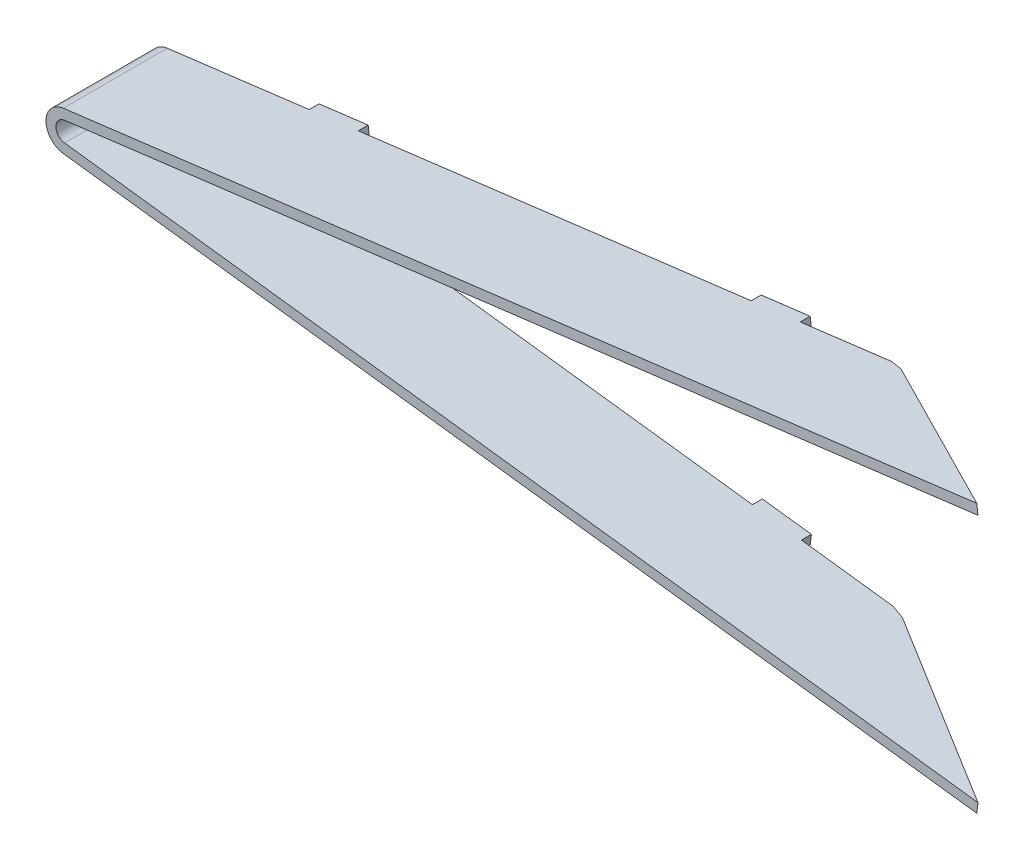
ISO-10303-21;
HEADER;
FILE_DESCRIPTION(('STEP AP214'),'2;1');
FILE_NAME('part.step','',(''),(''),'','','');
FILE_SCHEMA(('AUTOMOTIVE_DESIGN { 1 0 10303 214 1 1 1 1 }'));
ENDSEC;
DATA;
#1=APPLICATION_CONTEXT('core data for automotive mechanical design processes');
#2=APPLICATION_PROTOCOL_DEFINITION('international standard','automotive_design',2000,#1);
#3=PRODUCT_CONTEXT('',#1,'mechanical');
#4=PRODUCT('Part','Part','',(#3));
#5=PRODUCT_RELATED_PRODUCT_CATEGORY('part','',(#4));
#6=PRODUCT_DEFINITION_FORMATION('','',#4);
#7=PRODUCT_DEFINITION_CONTEXT('part definition',#1,'design');
#8=PRODUCT_DEFINITION('design','',#6,#7);
#9=PRODUCT_DEFINITION_SHAPE('','',#8);
#10=(LENGTH_UNIT() NAMED_UNIT(*) SI_UNIT(.MILLI.,.METRE.));
#11=(NAMED_UNIT(*) PLANE_ANGLE_UNIT() SI_UNIT($,.RADIAN.));
#12=(NAMED_UNIT(*) SI_UNIT($,.STERADIAN.) SOLID_ANGLE_UNIT());
#13=UNCERTAINTY_MEASURE_WITH_UNIT(LENGTH_MEASURE(1.E-05),#10,'distance_accuracy_value','');
#14=(GEOMETRIC_REPRESENTATION_CONTEXT(3) GLOBAL_UNCERTAINTY_ASSIGNED_CONTEXT((#13)) GLOBAL_UNIT_ASSIGNED_CONTEXT((#10,
#11,#12)) REPRESENTATION_CONTEXT('',''));
#15=CARTESIAN_POINT('',(0.,0.,0.));
#16=DIRECTION('',(0.,0.,1.));
#17=DIRECTION('',(1.,0.,0.));
#18=AXIS2_PLACEMENT_3D('',#15,#16,#17);
#19=CARTESIAN_POINT('',(-184.5536077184,-1.984447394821,0.));
#20=DIRECTION('',(-0.124467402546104,-0.992223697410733,0.));
#21=DIRECTION('',(0.992223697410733,-0.124467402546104,0.));
#22=AXIS2_PLACEMENT_3D('',#19,#20,#21);
#23=PLANE('',#22);
#24=DIRECTION('',(0.992223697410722,-0.124467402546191,0.));
#25=VECTOR('',#24,1.);
#26=CARTESIAN_POINT('',(-155.8783428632,-5.581555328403,-2.));
#27=LINE('',#26,#25);
#28=CARTESIAN_POINT('',(-155.878342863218,-5.58155532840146,-2.));
#29=VERTEX_POINT('',#28);
#30=CARTESIAN_POINT('',(-145.956105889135,-6.82622935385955,-2.));
#31=VERTEX_POINT('',#30);
#32=EDGE_CURVE('E265',#29,#31,#27,.T.);
#33=ORIENTED_EDGE('',*,*,#32,.F.);
#34=DIRECTION('',(0.,0.,1.));
#35=VECTOR('',#34,1.);
#36=CARTESIAN_POINT('',(-155.878342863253,-5.58155532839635,-1.));
#37=LINE('',#36,#35);
#38=CARTESIAN_POINT('',(-155.878342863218,-5.58155532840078,0.));
#39=VERTEX_POINT('',#38);
#40=EDGE_CURVE('E230',#39,#29,#37,.F.);
#41=ORIENTED_EDGE('',*,*,#40,.F.);
#42=DIRECTION('',(0.992223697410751,-0.124467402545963,0.));
#43=VECTOR('',#42,1.);
#44=CARTESIAN_POINT('',(-184.5536077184,-1.984447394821,0.));
#45=LINE('',#44,#43);
#46=CARTESIAN_POINT('',(-184.553607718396,-1.98444739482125,0.));
#47=VERTEX_POINT('',#46);
#48=EDGE_CURVE('E324',#47,#39,#45,.T.);
#49=ORIENTED_EDGE('',*,*,#48,.F.);
#50=DIRECTION('',(0.,0.,1.));
#51=VECTOR('',#50,1.);
#52=CARTESIAN_POINT('',(-184.5536077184,-1.9844473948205,0.));
#53=LINE('',#52,#51);
#54=CARTESIAN_POINT('',(-184.553607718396,-1.98444739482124,21.));
#55=VERTEX_POINT('',#54);
#56=EDGE_CURVE('E327',#47,#55,#53,.T.);
#57=ORIENTED_EDGE('',*,*,#56,.T.);
#58=DIRECTION('',(0.992223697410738,-0.124467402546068,0.));
#59=VECTOR('',#58,1.);
#60=CARTESIAN_POINT('',(-184.5536077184,-1.984447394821,21.));
#61=LINE('',#60,#59);
#62=CARTESIAN_POINT('',(2.03433886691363E-13,-25.13538426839,20.9999999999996));
#63=VERTEX_POINT('',#62);
#64=EDGE_CURVE('E213',#55,#63,#61,.T.);
#65=ORIENTED_EDGE('',*,*,#64,.T.);
#66=DIRECTION('',(0.863587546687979,-0.10833091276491,0.492423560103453));
#67=VECTOR('',#66,1.);
#68=CARTESIAN_POINT('',(-35.5944758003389,-20.6703105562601,0.703785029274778));
#69=LINE('',#68,#67);
#70=CARTESIAN_POINT('',(-35.5944758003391,-20.6703105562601,0.703785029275));
#71=VERTEX_POINT('',#70);
#72=EDGE_CURVE('E233',#71,#63,#69,.T.);
#73=ORIENTED_EDGE('',*,*,#72,.F.);
#74=DIRECTION('',(0.958414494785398,-0.120226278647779,0.258819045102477));
#75=VECTOR('',#74,1.);
#76=CARTESIAN_POINT('',(-38.2006123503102,-20.34338927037,5.40759386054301E-13));
#77=LINE('',#76,#75);
#78=CARTESIAN_POINT('',(-38.2006123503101,-20.34338927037,3.60506257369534E-13));
#79=VERTEX_POINT('',#78);
#80=EDGE_CURVE('E280',#79,#71,#77,.T.);
#81=ORIENTED_EDGE('',*,*,#80,.F.);
#82=DIRECTION('',(0.992223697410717,-0.124467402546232,0.));
#83=VECTOR('',#82,1.);
#84=CARTESIAN_POINT('',(-56.65597312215,-18.02829558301,0.));
#85=LINE('',#84,#83);
#86=CARTESIAN_POINT('',(-56.6559731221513,-18.0282955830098,0.));
#87=VERTEX_POINT('',#86);
#88=EDGE_CURVE('E285',#87,#79,#85,.T.);
#89=ORIENTED_EDGE('',*,*,#88,.F.);
#90=DIRECTION('',(0.,0.,1.));
#91=VECTOR('',#90,1.);
#92=CARTESIAN_POINT('',(-56.6559731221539,-18.0282955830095,-1.));
#93=LINE('',#92,#91);
#94=CARTESIAN_POINT('',(-56.6559731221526,-18.0282955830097,-2.));
#95=VERTEX_POINT('',#94);
#96=EDGE_CURVE('E288',#95,#87,#93,.T.);
#97=ORIENTED_EDGE('',*,*,#96,.F.);
#98=DIRECTION('',(0.99222369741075,-0.124467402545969,0.));
#99=VECTOR('',#98,1.);
#100=CARTESIAN_POINT('',(-66.57821009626,-16.78362155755,-2.));
#101=LINE('',#100,#99);
#102=CARTESIAN_POINT('',(-66.5782100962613,-16.7836215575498,-2.));
#103=VERTEX_POINT('',#102);
#104=EDGE_CURVE('E296',#103,#95,#101,.T.);
#105=ORIENTED_EDGE('',*,*,#104,.F.);
#106=DIRECTION('',(0.,0.,1.));
#107=VECTOR('',#106,1.);
#108=CARTESIAN_POINT('',(-66.5782100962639,-16.7836215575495,-1.));
#109=LINE('',#108,#107);
#110=CARTESIAN_POINT('',(-66.5782100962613,-16.7836215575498,0.));
#111=VERTEX_POINT('',#110);
#112=EDGE_CURVE('E240',#111,#103,#109,.F.);
#113=ORIENTED_EDGE('',*,*,#112,.F.);
#114=DIRECTION('',(0.992223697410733,-0.124467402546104,0.));
#115=VECTOR('',#114,1.);
#116=CARTESIAN_POINT('',(-145.9561058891,-6.826229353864,0.));
#117=LINE('',#116,#115);
#118=CARTESIAN_POINT('',(-145.956105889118,-6.82622935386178,0.));
#119=VERTEX_POINT('',#118);
#120=EDGE_CURVE('E245',#119,#111,#117,.T.);
#121=ORIENTED_EDGE('',*,*,#120,.F.);
#122=DIRECTION('',(0.,0.,1.));
#123=VECTOR('',#122,1.);
#124=CARTESIAN_POINT('',(-145.956105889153,-6.82622935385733,-1.));
#125=LINE('',#124,#123);
#126=EDGE_CURVE('E254',#31,#119,#125,.T.);
#127=ORIENTED_EDGE('',*,*,#126,.F.);
#128=EDGE_LOOP('',(#33,#41,#49,#57,#65,#73,#81,#89,#97,#105,#113,#121,#127));
#129=FACE_BOUND('',#128,.T.);
#130=ADVANCED_FACE('F17',(#129),#23,.F.);
#131=CARTESIAN_POINT('',(-66.70267749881,-17.77584525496,-1.));
#132=DIRECTION('',(-0.992223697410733,0.124467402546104,0.));
#133=DIRECTION('',(-0.124467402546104,-0.992223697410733,0.));
#134=AXIS2_PLACEMENT_3D('',#131,#132,#133);
#135=PLANE('',#134);
#136=DIRECTION('',(0.124467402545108,0.992223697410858,0.));
#137=VECTOR('',#136,1.);
#138=CARTESIAN_POINT('',(-66.82714490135,-18.76806895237,-2.));
#139=LINE('',#138,#137);
#140=CARTESIAN_POINT('',(-66.8271449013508,-18.7680689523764,-2.));
#141=VERTEX_POINT('',#140);
#142=EDGE_CURVE('E242',#141,#103,#139,.T.);
#143=ORIENTED_EDGE('',*,*,#142,.F.);
#144=DIRECTION('',(0.,0.,1.));
#145=VECTOR('',#144,1.);
#146=CARTESIAN_POINT('',(-66.8271449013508,-18.7680689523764,0.));
#147=LINE('',#146,#145);
#148=CARTESIAN_POINT('',(-66.8271449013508,-18.7680689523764,0.));
#149=VERTEX_POINT('',#148);
#150=EDGE_CURVE('E337',#149,#141,#147,.F.);
#151=ORIENTED_EDGE('',*,*,#150,.F.);
#152=DIRECTION('',(-0.124467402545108,-0.992223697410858,0.));
#153=VECTOR('',#152,1.);
#154=CARTESIAN_POINT('',(-66.57821009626,-16.78362155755,0.));
#155=LINE('',#154,#153);
#156=EDGE_CURVE('E248',#111,#149,#155,.T.);
#157=ORIENTED_EDGE('',*,*,#156,.F.);
#158=ORIENTED_EDGE('',*,*,#112,.T.);
#159=EDGE_LOOP('',(#143,#151,#157,#158));
#160=FACE_BOUND('',#159,.T.);
#161=ADVANCED_FACE('F399',(#160),#135,.T.);
#162=CARTESIAN_POINT('',(-61.74155901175,-18.39818226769,-2.));
#163=DIRECTION('',(0.,0.,-1.));
#164=DIRECTION('',(-1.,0.,0.));
#165=AXIS2_PLACEMENT_3D('',#162,#163,#164);
#166=PLANE('',#165);
#167=DIRECTION('',(0.124467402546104,0.992223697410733,0.));
#168=VECTOR('',#167,1.);
#169=CARTESIAN_POINT('',(-56.7804405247,-19.02051928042,-2.));
#170=LINE('',#169,#168);
#171=CARTESIAN_POINT('',(-56.9049079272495,-20.0127429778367,-2.));
#172=VERTEX_POINT('',#171);
#173=EDGE_CURVE('E293',#172,#95,#170,.T.);
#174=ORIENTED_EDGE('',*,*,#173,.F.);
#175=DIRECTION('',(0.992223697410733,-0.124467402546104,0.));
#176=VECTOR('',#175,1.);
#177=CARTESIAN_POINT('',(-184.8025425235,-3.968894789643,-2.));
#178=LINE('',#177,#176);
#179=EDGE_CURVE('E376',#141,#172,#178,.T.);
#180=ORIENTED_EDGE('',*,*,#179,.F.);
#181=ORIENTED_EDGE('',*,*,#142,.T.);
#182=ORIENTED_EDGE('',*,*,#104,.T.);
#183=EDGE_LOOP('',(#174,#180,#181,#182));
#184=FACE_BOUND('',#183,.T.);
#185=ADVANCED_FACE('F405',(#184),#166,.T.);
#186=CARTESIAN_POINT('',(-56.7804405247,-19.02051928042,-1.));
#187=DIRECTION('',(0.992223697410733,-0.124467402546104,0.));
#188=DIRECTION('',(0.124467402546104,0.992223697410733,0.));
#189=AXIS2_PLACEMENT_3D('',#186,#187,#188);
#190=PLANE('',#189);
#191=DIRECTION('',(0.12446740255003,0.992223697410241,0.));
#192=VECTOR('',#191,1.);
#193=CARTESIAN_POINT('',(-56.90490792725,-20.01274297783,0.));
#194=LINE('',#193,#192);
#195=CARTESIAN_POINT('',(-56.9049079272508,-20.0127429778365,0.));
#196=VERTEX_POINT('',#195);
#197=EDGE_CURVE('E287',#196,#87,#194,.T.);
#198=ORIENTED_EDGE('',*,*,#197,.F.);
#199=DIRECTION('',(0.,0.,1.));
#200=VECTOR('',#199,1.);
#201=CARTESIAN_POINT('',(-56.9049079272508,-20.0127429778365,0.));
#202=LINE('',#201,#200);
#203=EDGE_CURVE('E367',#172,#196,#202,.T.);
#204=ORIENTED_EDGE('',*,*,#203,.F.);
#205=ORIENTED_EDGE('',*,*,#173,.T.);
#206=ORIENTED_EDGE('',*,*,#96,.T.);
#207=EDGE_LOOP('',(#198,#204,#205,#206));
#208=FACE_BOUND('',#207,.T.);
#209=ADVANCED_FACE('F408',(#208),#190,.T.);
#210=CARTESIAN_POINT('',(-92.40127126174,-14.55213952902,0.));
#211=DIRECTION('',(0.,0.,-1.));
#212=DIRECTION('',(-1.,0.,0.));
#213=AXIS2_PLACEMENT_3D('',#210,#211,#212);
#214=PLANE('',#213);
#215=DIRECTION('',(0.992223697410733,-0.124467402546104,0.));
#216=VECTOR('',#215,1.);
#217=CARTESIAN_POINT('',(-184.8025425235,-3.968894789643,0.));
#218=LINE('',#217,#216);
#219=CARTESIAN_POINT('',(-38.4495471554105,-22.3278366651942,-4.90410994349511E-13));
#220=VERTEX_POINT('',#219);
#221=EDGE_CURVE('E358',#196,#220,#218,.T.);
#222=ORIENTED_EDGE('',*,*,#221,.F.);
#223=ORIENTED_EDGE('',*,*,#197,.T.);
#224=ORIENTED_EDGE('',*,*,#88,.T.);
#225=DIRECTION('',(0.124467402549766,0.992223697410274,9.8792840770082E-13));
#226=VECTOR('',#225,1.);
#227=CARTESIAN_POINT('',(-38.4495471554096,-22.32783666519,-1.43509742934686E-12));
#228=LINE('',#227,#226);
#229=EDGE_CURVE('E282',#220,#79,#228,.T.);
#230=ORIENTED_EDGE('',*,*,#229,.F.);
#231=EDGE_LOOP('',(#222,#223,#224,#230));
#232=FACE_BOUND('',#231,.T.);
#233=ADVANCED_FACE('F411',(#232),#214,.T.);
#234=CARTESIAN_POINT('',(-37.02201147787,-21.49907361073,0.3518925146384));
#235=DIRECTION('',(0.256806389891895,-0.0322145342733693,-0.96592582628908));
#236=DIRECTION('',(-0.96642742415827,0.,-0.256939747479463));
#237=AXIS2_PLACEMENT_3D('',#234,#235,#236);
#238=PLANE('',#237);
#239=DIRECTION('',(0.124467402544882,0.992223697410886,-6.96925156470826E-13));
#240=VECTOR('',#239,1.);
#241=CARTESIAN_POINT('',(-35.8434106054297,-22.65475795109,0.703785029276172));
#242=LINE('',#241,#240);
#243=CARTESIAN_POINT('',(-35.8434106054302,-22.6547579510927,0.703785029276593));
#244=VERTEX_POINT('',#243);
#245=EDGE_CURVE('E237',#244,#71,#242,.T.);
#246=ORIENTED_EDGE('',*,*,#245,.F.);
#247=DIRECTION('',(0.958414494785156,-0.120226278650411,0.258819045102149));
#248=VECTOR('',#247,1.);
#249=CARTESIAN_POINT('',(-38.4495471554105,-22.3278366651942,0.));
#250=LINE('',#249,#248);
#251=EDGE_CURVE('E349',#220,#244,#250,.T.);
#252=ORIENTED_EDGE('',*,*,#251,.F.);
#253=ORIENTED_EDGE('',*,*,#229,.T.);
#254=ORIENTED_EDGE('',*,*,#80,.T.);
#255=EDGE_LOOP('',(#246,#252,#253,#254));
#256=FACE_BOUND('',#255,.T.);
#257=ADVANCED_FACE('F415',(#256),#238,.T.);
#258=CARTESIAN_POINT('',(-17.92170530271,-23.89507110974,10.85189251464));
#259=DIRECTION('',(0.488594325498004,-0.0612906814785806,-0.870355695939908));
#260=DIRECTION('',(-0.871995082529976,0.,-0.489514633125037));
#261=AXIS2_PLACEMENT_3D('',#258,#259,#260);
#262=PLANE('',#261);
#263=DIRECTION('',(-0.124467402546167,-0.992223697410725,0.));
#264=VECTOR('',#263,1.);
#265=CARTESIAN_POINT('',(0.,-25.13538426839,21.));
#266=LINE('',#265,#264);
#267=CARTESIAN_POINT('',(-0.248934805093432,-27.1198316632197,21.));
#268=VERTEX_POINT('',#267);
#269=EDGE_CURVE('E333',#63,#268,#266,.T.);
#270=ORIENTED_EDGE('',*,*,#269,.T.);
#271=DIRECTION('',(0.863587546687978,-0.108330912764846,0.492423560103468));
#272=VECTOR('',#271,1.);
#273=CARTESIAN_POINT('',(-35.8434106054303,-22.6547579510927,0.7037850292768));
#274=LINE('',#273,#272);
#275=EDGE_CURVE('E321',#244,#268,#274,.T.);
#276=ORIENTED_EDGE('',*,*,#275,.F.);
#277=ORIENTED_EDGE('',*,*,#245,.T.);
#278=ORIENTED_EDGE('',*,*,#72,.T.);
#279=EDGE_LOOP('',(#270,#276,#277,#278));
#280=FACE_BOUND('',#279,.T.);
#281=ADVANCED_FACE('F419',(#280),#262,.T.);
#282=CARTESIAN_POINT('',(-156.0028102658,-6.573779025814,-1.));
#283=DIRECTION('',(-0.992223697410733,0.124467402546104,0.));
#284=DIRECTION('',(-0.124467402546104,-0.992223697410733,0.));
#285=AXIS2_PLACEMENT_3D('',#282,#283,#284);
#286=PLANE('',#285);
#287=DIRECTION('',(0.124467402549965,0.992223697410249,0.));
#288=VECTOR('',#287,1.);
#289=CARTESIAN_POINT('',(-156.1272776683,-7.566002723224,-2.));
#290=LINE('',#289,#288);
#291=CARTESIAN_POINT('',(-156.127277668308,-7.56600272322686,-2.));
#292=VERTEX_POINT('',#291);
#293=EDGE_CURVE('E232',#292,#29,#290,.T.);
#294=ORIENTED_EDGE('',*,*,#293,.F.);
#295=DIRECTION('',(0.,0.,1.));
#296=VECTOR('',#295,1.);
#297=CARTESIAN_POINT('',(-156.127277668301,-7.56600272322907,0.));
#298=LINE('',#297,#296);
#299=CARTESIAN_POINT('',(-156.127277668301,-7.56600272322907,0.));
#300=VERTEX_POINT('',#299);
#301=EDGE_CURVE('E273',#300,#292,#298,.F.);
#302=ORIENTED_EDGE('',*,*,#301,.F.);
#303=DIRECTION('',(-0.124467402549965,-0.992223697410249,0.));
#304=VECTOR('',#303,1.);
#305=CARTESIAN_POINT('',(-155.8783428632,-5.581555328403,0.));
#306=LINE('',#305,#304);
#307=EDGE_CURVE('E326',#39,#300,#306,.T.);
#308=ORIENTED_EDGE('',*,*,#307,.F.);
#309=ORIENTED_EDGE('',*,*,#40,.T.);
#310=EDGE_LOOP('',(#294,#302,#308,#309));
#311=FACE_BOUND('',#310,.T.);
#312=ADVANCED_FACE('F431',(#311),#286,.T.);
#313=CARTESIAN_POINT('',(-151.0416917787,-7.196116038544,-2.));
#314=DIRECTION('',(0.,0.,-1.));
#315=DIRECTION('',(-1.,0.,0.));
#316=AXIS2_PLACEMENT_3D('',#313,#314,#315);
#317=PLANE('',#316);
#318=DIRECTION('',(0.124467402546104,0.992223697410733,0.));
#319=VECTOR('',#318,1.);
#320=CARTESIAN_POINT('',(-146.0805732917,-7.818453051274,-2.));
#321=LINE('',#320,#319);
#322=CARTESIAN_POINT('',(-146.205040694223,-8.81067674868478,-2.));
#323=VERTEX_POINT('',#322);
#324=EDGE_CURVE('E258',#323,#31,#321,.T.);
#325=ORIENTED_EDGE('',*,*,#324,.F.);
#326=DIRECTION('',(0.992223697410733,-0.124467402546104,0.));
#327=VECTOR('',#326,1.);
#328=CARTESIAN_POINT('',(-184.8025425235,-3.968894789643,-2.));
#329=LINE('',#328,#327);
#330=EDGE_CURVE('E222',#292,#323,#329,.T.);
#331=ORIENTED_EDGE('',*,*,#330,.F.);
#332=ORIENTED_EDGE('',*,*,#293,.T.);
#333=ORIENTED_EDGE('',*,*,#32,.T.);
#334=EDGE_LOOP('',(#325,#331,#332,#333));
#335=FACE_BOUND('',#334,.T.);
#336=ADVANCED_FACE('F435',(#335),#317,.T.);
#337=CARTESIAN_POINT('',(-146.0805732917,-7.818453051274,-1.));
#338=DIRECTION('',(0.992223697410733,-0.124467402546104,0.));
#339=DIRECTION('',(0.124467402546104,0.992223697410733,0.));
#340=AXIS2_PLACEMENT_3D('',#337,#338,#339);
#341=PLANE('',#340);
#342=DIRECTION('',(0.124467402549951,0.992223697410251,0.));
#343=VECTOR('',#342,1.);
#344=CARTESIAN_POINT('',(-146.2050406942,-8.810676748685,0.));
#345=LINE('',#344,#343);
#346=CARTESIAN_POINT('',(-146.205040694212,-8.81067674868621,0.));
#347=VERTEX_POINT('',#346);
#348=EDGE_CURVE('E249',#347,#119,#345,.T.);
#349=ORIENTED_EDGE('',*,*,#348,.F.);
#350=DIRECTION('',(0.,0.,1.));
#351=VECTOR('',#350,1.);
#352=CARTESIAN_POINT('',(-146.205040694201,-8.81067674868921,0.));
#353=LINE('',#352,#351);
#354=EDGE_CURVE('E216',#323,#347,#353,.T.);
#355=ORIENTED_EDGE('',*,*,#354,.F.);
#356=ORIENTED_EDGE('',*,*,#324,.T.);
#357=ORIENTED_EDGE('',*,*,#126,.T.);
#358=EDGE_LOOP('',(#349,#355,#356,#357));
#359=FACE_BOUND('',#358,.T.);
#360=ADVANCED_FACE('F439',(#359),#341,.T.);
#361=CARTESIAN_POINT('',(-106.3916253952,-12.79714915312,0.));
#362=DIRECTION('',(0.,0.,-1.));
#363=DIRECTION('',(-1.,0.,0.));
#364=AXIS2_PLACEMENT_3D('',#361,#362,#363);
#365=PLANE('',#364);
#366=ORIENTED_EDGE('',*,*,#156,.T.);
#367=DIRECTION('',(0.992223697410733,-0.124467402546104,0.));
#368=VECTOR('',#367,1.);
#369=CARTESIAN_POINT('',(-184.8025425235,-3.968894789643,0.));
#370=LINE('',#369,#368);
#371=EDGE_CURVE('E214',#347,#149,#370,.T.);
#372=ORIENTED_EDGE('',*,*,#371,.F.);
#373=ORIENTED_EDGE('',*,*,#348,.T.);
#374=ORIENTED_EDGE('',*,*,#120,.T.);
#375=EDGE_LOOP('',(#366,#372,#373,#374));
#376=FACE_BOUND('',#375,.T.);
#377=ADVANCED_FACE('F396',(#376),#365,.T.);
#378=CARTESIAN_POINT('',(-184.3046729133,0.,0.));
#379=DIRECTION('',(0.,0.,1.));
#380=DIRECTION('',(1.,0.,0.));
#381=AXIS2_PLACEMENT_3D('',#378,#379,#380);
#382=CYLINDRICAL_SURFACE('',#381,2.);
#383=CARTESIAN_POINT('',(-184.3046729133,0.,21.));
#384=DIRECTION('',(0.,0.,1.));
#385=DIRECTION('',(1.,0.,0.));
#386=AXIS2_PLACEMENT_3D('',#383,#384,#385);
#387=CIRCLE('',#386,2.);
#388=CARTESIAN_POINT('',(-184.553607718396,1.98444739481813,21.));
#389=VERTEX_POINT('',#388);
#390=EDGE_CURVE('E20',#389,#55,#387,.T.);
#391=ORIENTED_EDGE('',*,*,#390,.T.);
#392=ORIENTED_EDGE('',*,*,#56,.F.);
#393=CARTESIAN_POINT('',(-184.3046729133,0.,0.));
#394=DIRECTION('',(0.,0.,1.));
#395=DIRECTION('',(1.,0.,0.));
#396=AXIS2_PLACEMENT_3D('',#393,#394,#395);
#397=CIRCLE('',#396,2.);
#398=CARTESIAN_POINT('',(-184.553607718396,1.98444739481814,0.));
#399=VERTEX_POINT('',#398);
#400=EDGE_CURVE('E194',#399,#47,#397,.T.);
#401=ORIENTED_EDGE('',*,*,#400,.F.);
#402=DIRECTION('',(0.,0.,1.));
#403=VECTOR('',#402,1.);
#404=CARTESIAN_POINT('',(-184.553607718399,1.98444739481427,0.));
#405=LINE('',#404,#403);
#406=EDGE_CURVE('E187',#399,#389,#405,.T.);
#407=ORIENTED_EDGE('',*,*,#406,.T.);
#408=EDGE_LOOP('',(#391,#392,#401,#407));
#409=FACE_BOUND('',#408,.T.);
#410=ADVANCED_FACE('F189',(#409),#382,.F.);
#411=CARTESIAN_POINT('',(-184.8025425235,-3.968894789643,0.));
#412=DIRECTION('',(-0.124467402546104,-0.992223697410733,0.));
#413=DIRECTION('',(0.992223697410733,-0.124467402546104,0.));
#414=AXIS2_PLACEMENT_3D('',#411,#412,#413);
#415=PLANE('',#414);
#416=ORIENTED_EDGE('',*,*,#354,.T.);
#417=ORIENTED_EDGE('',*,*,#371,.T.);
#418=ORIENTED_EDGE('',*,*,#150,.T.);
#419=ORIENTED_EDGE('',*,*,#179,.T.);
#420=ORIENTED_EDGE('',*,*,#203,.T.);
#421=ORIENTED_EDGE('',*,*,#221,.T.);
#422=ORIENTED_EDGE('',*,*,#251,.T.);
#423=ORIENTED_EDGE('',*,*,#275,.T.);
#424=DIRECTION('',(0.992223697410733,-0.124467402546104,0.));
#425=VECTOR('',#424,1.);
#426=CARTESIAN_POINT('',(-184.8025425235,-3.968894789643,21.));
#427=LINE('',#426,#425);
#428=CARTESIAN_POINT('',(-184.802542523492,-3.96889478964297,21.));
#429=VERTEX_POINT('',#428);
#430=EDGE_CURVE('E317',#268,#429,#427,.F.);
#431=ORIENTED_EDGE('',*,*,#430,.T.);
#432=DIRECTION('',(0.,0.,1.));
#433=VECTOR('',#432,1.);
#434=CARTESIAN_POINT('',(-184.8025425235,-3.96889478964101,0.));
#435=LINE('',#434,#433);
#436=CARTESIAN_POINT('',(-184.802542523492,-3.96889478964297,0.));
#437=VERTEX_POINT('',#436);
#438=EDGE_CURVE('E303',#437,#429,#435,.T.);
#439=ORIENTED_EDGE('',*,*,#438,.F.);
#440=DIRECTION('',(0.992223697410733,-0.124467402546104,0.));
#441=VECTOR('',#440,1.);
#442=CARTESIAN_POINT('',(-184.8025425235,-3.968894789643,0.));
#443=LINE('',#442,#441);
#444=EDGE_CURVE('E314',#437,#300,#443,.T.);
#445=ORIENTED_EDGE('',*,*,#444,.T.);
#446=ORIENTED_EDGE('',*,*,#301,.T.);
#447=ORIENTED_EDGE('',*,*,#330,.T.);
#448=EDGE_LOOP('',(#416,#417,#418,#419,#420,#421,#422,#423,#431,#439,#445,#446,#447));
#449=FACE_BOUND('',#448,.T.);
#450=ADVANCED_FACE('F402',(#449),#415,.T.);
#451=CARTESIAN_POINT('',(0.,25.13538426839,0.));
#452=DIRECTION('',(-0.124467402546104,0.992223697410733,0.));
#453=DIRECTION('',(-0.992223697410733,-0.124467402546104,0.));
#454=AXIS2_PLACEMENT_3D('',#451,#452,#453);
#455=PLANE('',#454);
#456=DIRECTION('',(-0.86358754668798,-0.10833091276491,-0.492423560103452));
#457=VECTOR('',#456,1.);
#458=CARTESIAN_POINT('',(6.62068056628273E-13,25.1353842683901,20.9999999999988));
#459=LINE('',#458,#457);
#460=CARTESIAN_POINT('',(4.32192401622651E-13,25.1353842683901,20.9999999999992));
#461=VERTEX_POINT('',#460);
#462=CARTESIAN_POINT('',(-35.5944758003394,20.6703105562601,0.70378502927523));
#463=VERTEX_POINT('',#462);
#464=EDGE_CURVE('E203',#461,#463,#459,.T.);
#465=ORIENTED_EDGE('',*,*,#464,.F.);
#466=DIRECTION('',(-0.992223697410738,-0.124467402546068,0.));
#467=VECTOR('',#466,1.);
#468=CARTESIAN_POINT('',(0.,25.13538426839,21.));
#469=LINE('',#468,#467);
#470=EDGE_CURVE('E200',#461,#389,#469,.T.);
#471=ORIENTED_EDGE('',*,*,#470,.T.);
#472=ORIENTED_EDGE('',*,*,#406,.F.);
#473=DIRECTION('',(-0.992223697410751,-0.124467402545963,0.));
#474=VECTOR('',#473,1.);
#475=CARTESIAN_POINT('',(-155.8783428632,5.581555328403,0.));
#476=LINE('',#475,#474);
#477=CARTESIAN_POINT('',(-155.878342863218,5.58155532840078,0.));
#478=VERTEX_POINT('',#477);
#479=EDGE_CURVE('E779',#478,#399,#476,.T.);
#480=ORIENTED_EDGE('',*,*,#479,.F.);
#481=DIRECTION('',(0.,0.,1.));
#482=VECTOR('',#481,1.);
#483=CARTESIAN_POINT('',(-155.878342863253,5.58155532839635,-1.));
#484=LINE('',#483,#482);
#485=CARTESIAN_POINT('',(-155.878342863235,5.58155532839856,-2.));
#486=VERTEX_POINT('',#485);
#487=EDGE_CURVE('E770',#486,#478,#484,.T.);
#488=ORIENTED_EDGE('',*,*,#487,.F.);
#489=DIRECTION('',(-0.992223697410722,-0.124467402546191,0.));
#490=VECTOR('',#489,1.);
#491=CARTESIAN_POINT('',(-145.9561058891,6.826229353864,-2.));
#492=LINE('',#491,#490);
#493=CARTESIAN_POINT('',(-145.956105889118,6.82622935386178,-2.));
#494=VERTEX_POINT('',#493);
#495=EDGE_CURVE('E757',#494,#486,#492,.T.);
#496=ORIENTED_EDGE('',*,*,#495,.F.);
#497=DIRECTION('',(0.,0.,1.));
#498=VECTOR('',#497,1.);
#499=CARTESIAN_POINT('',(-145.956105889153,6.82622935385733,-1.));
#500=LINE('',#499,#498);
#501=CARTESIAN_POINT('',(-145.956105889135,6.82622935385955,0.));
#502=VERTEX_POINT('',#501);
#503=EDGE_CURVE('E743',#502,#494,#500,.F.);
#504=ORIENTED_EDGE('',*,*,#503,.F.);
#505=DIRECTION('',(-0.992223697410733,-0.124467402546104,0.));
#506=VECTOR('',#505,1.);
#507=CARTESIAN_POINT('',(-66.57821009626,16.78362155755,0.));
#508=LINE('',#507,#506);
#509=CARTESIAN_POINT('',(-66.5782100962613,16.7836215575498,0.));
#510=VERTEX_POINT('',#509);
#511=EDGE_CURVE('E729',#510,#502,#508,.T.);
#512=ORIENTED_EDGE('',*,*,#511,.F.);
#513=DIRECTION('',(0.,0.,1.));
#514=VECTOR('',#513,1.);
#515=CARTESIAN_POINT('',(-66.5782100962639,16.7836215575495,-1.));
#516=LINE('',#515,#514);
#517=CARTESIAN_POINT('',(-66.5782100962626,16.7836215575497,-2.));
#518=VERTEX_POINT('',#517);
#519=EDGE_CURVE('E715',#518,#510,#516,.T.);
#520=ORIENTED_EDGE('',*,*,#519,.F.);
#521=DIRECTION('',(-0.99222369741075,-0.124467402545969,0.));
#522=VECTOR('',#521,1.);
#523=CARTESIAN_POINT('',(-56.65597312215,18.02829558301,-2.));
#524=LINE('',#523,#522);
#525=CARTESIAN_POINT('',(-56.6559731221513,18.0282955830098,-2.));
#526=VERTEX_POINT('',#525);
#527=EDGE_CURVE('E701',#526,#518,#524,.T.);
#528=ORIENTED_EDGE('',*,*,#527,.F.);
#529=DIRECTION('',(0.,0.,1.));
#530=VECTOR('',#529,1.);
#531=CARTESIAN_POINT('',(-56.6559731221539,18.0282955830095,-1.));
#532=LINE('',#531,#530);
#533=CARTESIAN_POINT('',(-56.6559731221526,18.0282955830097,0.));
#534=VERTEX_POINT('',#533);
#535=EDGE_CURVE('E687',#534,#526,#532,.F.);
#536=ORIENTED_EDGE('',*,*,#535,.F.);
#537=DIRECTION('',(-0.992223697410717,-0.124467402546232,0.));
#538=VECTOR('',#537,1.);
#539=CARTESIAN_POINT('',(-38.20061235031,20.34338927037,0.));
#540=LINE('',#539,#538);
#541=CARTESIAN_POINT('',(-38.2006123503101,20.34338927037,1.80230541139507E-13));
#542=VERTEX_POINT('',#541);
#543=EDGE_CURVE('E674',#542,#534,#540,.T.);
#544=ORIENTED_EDGE('',*,*,#543,.F.);
#545=DIRECTION('',(-0.958414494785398,-0.120226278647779,-0.258819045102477));
#546=VECTOR('',#545,1.);
#547=CARTESIAN_POINT('',(-35.5944758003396,20.67031055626,0.703785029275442));
#548=LINE('',#547,#546);
#549=EDGE_CURVE('E641',#463,#542,#548,.T.);
#550=ORIENTED_EDGE('',*,*,#549,.F.);
#551=EDGE_LOOP('',(#465,#471,#472,#480,#488,#496,#504,#512,#520,#528,#536,#544,#550));
#552=FACE_BOUND('',#551,.T.);
#553=ADVANCED_FACE('F201',(#552),#455,.F.);
#554=CARTESIAN_POINT('',(-184.3046729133,0.,0.));
#555=DIRECTION('',(0.,0.,1.));
#556=DIRECTION('',(1.,0.,0.));
#557=AXIS2_PLACEMENT_3D('',#554,#555,#556);
#558=CYLINDRICAL_SURFACE('',#557,4.);
#559=DIRECTION('',(0.,0.,1.));
#560=VECTOR('',#559,1.);
#561=CARTESIAN_POINT('',(-184.802542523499,3.96889478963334,0.));
#562=LINE('',#561,#560);
#563=CARTESIAN_POINT('',(-184.802542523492,3.96889478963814,0.));
#564=VERTEX_POINT('',#563);
#565=CARTESIAN_POINT('',(-184.802542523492,3.96889478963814,21.));
#566=VERTEX_POINT('',#565);
#567=EDGE_CURVE('E425',#564,#566,#562,.T.);
#568=ORIENTED_EDGE('',*,*,#567,.F.);
#569=CARTESIAN_POINT('',(-184.3046729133,0.,0.));
#570=DIRECTION('',(0.,0.,1.));
#571=DIRECTION('',(1.,0.,0.));
#572=AXIS2_PLACEMENT_3D('',#569,#570,#571);
#573=CIRCLE('',#572,4.);
#574=EDGE_CURVE('E207',#564,#437,#573,.T.);
#575=ORIENTED_EDGE('',*,*,#574,.T.);
#576=ORIENTED_EDGE('',*,*,#438,.T.);
#577=CARTESIAN_POINT('',(-184.3046729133,0.,21.));
#578=DIRECTION('',(0.,0.,1.));
#579=DIRECTION('',(1.,0.,0.));
#580=AXIS2_PLACEMENT_3D('',#577,#578,#579);
#581=CIRCLE('',#580,4.);
#582=EDGE_CURVE('E302',#429,#566,#581,.F.);
#583=ORIENTED_EDGE('',*,*,#582,.T.);
#584=EDGE_LOOP('',(#568,#575,#576,#583));
#585=FACE_BOUND('',#584,.T.);
#586=ADVANCED_FACE('F423',(#585),#558,.T.);
#587=CARTESIAN_POINT('',(-92.40127126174,14.55213952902,21.));
#588=DIRECTION('',(0.,0.,-1.));
#589=DIRECTION('',(-1.,0.,0.));
#590=AXIS2_PLACEMENT_3D('',#587,#588,#589);
#591=PLANE('',#590);
#592=DIRECTION('',(-0.992223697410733,-0.124467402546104,0.));
#593=VECTOR('',#592,1.);
#594=CARTESIAN_POINT('',(-0.2489348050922,27.11983166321,21.));
#595=LINE('',#594,#593);
#596=CARTESIAN_POINT('',(-0.248934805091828,27.11983166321,20.9999999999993));
#597=VERTEX_POINT('',#596);
#598=EDGE_CURVE('E651',#566,#597,#595,.F.);
#599=ORIENTED_EDGE('',*,*,#598,.F.);
#600=ORIENTED_EDGE('',*,*,#582,.F.);
#601=ORIENTED_EDGE('',*,*,#430,.F.);
#602=ORIENTED_EDGE('',*,*,#269,.F.);
#603=ORIENTED_EDGE('',*,*,#64,.F.);
#604=ORIENTED_EDGE('',*,*,#390,.F.);
#605=ORIENTED_EDGE('',*,*,#470,.F.);
#606=DIRECTION('',(0.124467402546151,-0.992223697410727,0.));
#607=VECTOR('',#606,1.);
#608=CARTESIAN_POINT('',(-0.248934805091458,27.1198316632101,20.9999999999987));
#609=LINE('',#608,#607);
#610=EDGE_CURVE('E206',#597,#461,#609,.T.);
#611=ORIENTED_EDGE('',*,*,#610,.F.);
#612=EDGE_LOOP('',(#599,#600,#601,#602,#603,#604,#605,#611));
#613=FACE_BOUND('',#612,.T.);
#614=ADVANCED_FACE('F210',(#613),#591,.F.);
#615=CARTESIAN_POINT('',(-17.92170530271,23.89507110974,10.85189251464));
#616=DIRECTION('',(0.488594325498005,0.0612906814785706,-0.870355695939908));
#617=DIRECTION('',(-0.871995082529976,0.,-0.489514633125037));
#618=AXIS2_PLACEMENT_3D('',#615,#616,#617);
#619=PLANE('',#618);
#620=DIRECTION('',(0.124467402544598,-0.992223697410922,-4.07876857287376E-13));
#621=VECTOR('',#620,1.);
#622=CARTESIAN_POINT('',(-35.8434106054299,22.65475795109,0.703785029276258));
#623=LINE('',#622,#621);
#624=CARTESIAN_POINT('',(-35.8434106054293,22.6547579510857,0.703785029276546));
#625=VERTEX_POINT('',#624);
#626=EDGE_CURVE('E636',#625,#463,#623,.T.);
#627=ORIENTED_EDGE('',*,*,#626,.F.);
#628=DIRECTION('',(-0.863587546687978,-0.108330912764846,-0.492423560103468));
#629=VECTOR('',#628,1.);
#630=CARTESIAN_POINT('',(-0.2489348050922,27.11983166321,21.));
#631=LINE('',#630,#629);
#632=EDGE_CURVE('E639',#597,#625,#631,.T.);
#633=ORIENTED_EDGE('',*,*,#632,.F.);
#634=ORIENTED_EDGE('',*,*,#610,.T.);
#635=ORIENTED_EDGE('',*,*,#464,.T.);
#636=EDGE_LOOP('',(#627,#633,#634,#635));
#637=FACE_BOUND('',#636,.T.);
#638=ADVANCED_FACE('F489',(#637),#619,.T.);
#639=CARTESIAN_POINT('',(-37.02201147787,21.49907361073,0.3518925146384));
#640=DIRECTION('',(0.256806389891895,0.0322145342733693,-0.96592582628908));
#641=DIRECTION('',(-0.96642742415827,0.,-0.256939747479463));
#642=AXIS2_PLACEMENT_3D('',#639,#640,#641);
#643=PLANE('',#642);
#644=DIRECTION('',(0.12446740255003,-0.992223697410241,0.));
#645=VECTOR('',#644,1.);
#646=CARTESIAN_POINT('',(-38.44954715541,22.32783666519,0.));
#647=LINE('',#646,#645);
#648=CARTESIAN_POINT('',(-38.4495471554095,22.3278366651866,0.));
#649=VERTEX_POINT('',#648);
#650=EDGE_CURVE('E646',#649,#542,#647,.T.);
#651=ORIENTED_EDGE('',*,*,#650,.F.);
#652=DIRECTION('',(-0.958414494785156,-0.120226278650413,-0.258819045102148));
#653=VECTOR('',#652,1.);
#654=CARTESIAN_POINT('',(-35.8434106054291,22.654757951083,0.7037850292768));
#655=LINE('',#654,#653);
#656=EDGE_CURVE('E644',#625,#649,#655,.T.);
#657=ORIENTED_EDGE('',*,*,#656,.F.);
#658=ORIENTED_EDGE('',*,*,#626,.T.);
#659=ORIENTED_EDGE('',*,*,#549,.T.);
#660=EDGE_LOOP('',(#651,#657,#658,#659));
#661=FACE_BOUND('',#660,.T.);
#662=ADVANCED_FACE('F485',(#661),#643,.T.);
#663=CARTESIAN_POINT('',(-92.40127126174,14.55213952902,0.));
#664=DIRECTION('',(0.,0.,-1.));
#665=DIRECTION('',(-1.,0.,0.));
#666=AXIS2_PLACEMENT_3D('',#663,#664,#665);
#667=PLANE('',#666);
#668=ORIENTED_EDGE('',*,*,#543,.T.);
#669=DIRECTION('',(-0.124467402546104,0.992223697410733,0.));
#670=VECTOR('',#669,1.);
#671=CARTESIAN_POINT('',(-56.7804405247,19.02051928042,0.));
#672=LINE('',#671,#670);
#673=CARTESIAN_POINT('',(-56.9049079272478,20.0127429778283,0.));
#674=VERTEX_POINT('',#673);
#675=EDGE_CURVE('E682',#674,#534,#672,.F.);
#676=ORIENTED_EDGE('',*,*,#675,.F.);
#677=DIRECTION('',(-0.992223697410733,-0.124467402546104,0.));
#678=VECTOR('',#677,1.);
#679=CARTESIAN_POINT('',(-0.2489348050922,27.11983166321,0.));
#680=LINE('',#679,#678);
#681=EDGE_CURVE('E649',#649,#674,#680,.T.);
#682=ORIENTED_EDGE('',*,*,#681,.F.);
#683=ORIENTED_EDGE('',*,*,#650,.T.);
#684=EDGE_LOOP('',(#668,#676,#682,#683));
#685=FACE_BOUND('',#684,.T.);
#686=ADVANCED_FACE('F481',(#685),#667,.T.);
#687=CARTESIAN_POINT('',(-56.7804405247,19.02051928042,-1.));
#688=DIRECTION('',(0.992223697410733,0.124467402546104,0.));
#689=DIRECTION('',(-0.124467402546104,0.992223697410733,0.));
#690=AXIS2_PLACEMENT_3D('',#687,#688,#689);
#691=PLANE('',#690);
#692=DIRECTION('',(0.12446740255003,-0.992223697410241,0.));
#693=VECTOR('',#692,1.);
#694=CARTESIAN_POINT('',(-56.90490792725,20.01274297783,-2.));
#695=LINE('',#694,#693);
#696=CARTESIAN_POINT('',(-56.9049079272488,20.0127429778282,-2.));
#697=VERTEX_POINT('',#696);
#698=EDGE_CURVE('E696',#697,#526,#695,.T.);
#699=ORIENTED_EDGE('',*,*,#698,.F.);
#700=DIRECTION('',(0.,0.,1.));
#701=VECTOR('',#700,1.);
#702=CARTESIAN_POINT('',(-56.9049079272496,20.0127429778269,0.));
#703=LINE('',#702,#701);
#704=EDGE_CURVE('E678',#674,#697,#703,.F.);
#705=ORIENTED_EDGE('',*,*,#704,.F.);
#706=ORIENTED_EDGE('',*,*,#675,.T.);
#707=ORIENTED_EDGE('',*,*,#535,.T.);
#708=EDGE_LOOP('',(#699,#705,#706,#707));
#709=FACE_BOUND('',#708,.T.);
#710=ADVANCED_FACE('F477',(#709),#691,.T.);
#711=CARTESIAN_POINT('',(-61.74155901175,18.39818226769,-2.));
#712=DIRECTION('',(0.,0.,-1.));
#713=DIRECTION('',(-1.,0.,0.));
#714=AXIS2_PLACEMENT_3D('',#711,#712,#713);
#715=PLANE('',#714);
#716=DIRECTION('',(0.124467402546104,-0.992223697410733,0.));
#717=VECTOR('',#716,1.);
#718=CARTESIAN_POINT('',(-66.70267749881,17.77584525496,-2.));
#719=LINE('',#718,#717);
#720=CARTESIAN_POINT('',(-66.8271449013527,18.7680689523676,-2.));
#721=VERTEX_POINT('',#720);
#722=EDGE_CURVE('E710',#721,#518,#719,.T.);
#723=ORIENTED_EDGE('',*,*,#722,.F.);
#724=DIRECTION('',(-0.992223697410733,-0.124467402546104,0.));
#725=VECTOR('',#724,1.);
#726=CARTESIAN_POINT('',(-0.2489348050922,27.11983166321,-2.));
#727=LINE('',#726,#725);
#728=EDGE_CURVE('E692',#697,#721,#727,.T.);
#729=ORIENTED_EDGE('',*,*,#728,.F.);
#730=ORIENTED_EDGE('',*,*,#698,.T.);
#731=ORIENTED_EDGE('',*,*,#527,.T.);
#732=EDGE_LOOP('',(#723,#729,#730,#731));
#733=FACE_BOUND('',#732,.T.);
#734=ADVANCED_FACE('F473',(#733),#715,.T.);
#735=CARTESIAN_POINT('',(-66.70267749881,17.77584525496,-1.));
#736=DIRECTION('',(-0.992223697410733,-0.124467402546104,0.));
#737=DIRECTION('',(0.124467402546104,-0.992223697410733,0.));
#738=AXIS2_PLACEMENT_3D('',#735,#736,#737);
#739=PLANE('',#738);
#740=DIRECTION('',(0.124467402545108,-0.992223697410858,0.));
#741=VECTOR('',#740,1.);
#742=CARTESIAN_POINT('',(-66.82714490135,18.76806895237,0.));
#743=LINE('',#742,#741);
#744=CARTESIAN_POINT('',(-66.8271449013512,18.7680689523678,0.));
#745=VERTEX_POINT('',#744);
#746=EDGE_CURVE('E724',#745,#510,#743,.T.);
#747=ORIENTED_EDGE('',*,*,#746,.F.);
#748=DIRECTION('',(0.,0.,1.));
#749=VECTOR('',#748,1.);
#750=CARTESIAN_POINT('',(-66.8271449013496,18.7680689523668,0.));
#751=LINE('',#750,#749);
#752=EDGE_CURVE('E706',#721,#745,#751,.T.);
#753=ORIENTED_EDGE('',*,*,#752,.F.);
#754=ORIENTED_EDGE('',*,*,#722,.T.);
#755=ORIENTED_EDGE('',*,*,#519,.T.);
#756=EDGE_LOOP('',(#747,#753,#754,#755));
#757=FACE_BOUND('',#756,.T.);
#758=ADVANCED_FACE('F469',(#757),#739,.T.);
#759=CARTESIAN_POINT('',(-106.3916253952,12.79714915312,0.));
#760=DIRECTION('',(0.,0.,-1.));
#761=DIRECTION('',(-1.,0.,0.));
#762=AXIS2_PLACEMENT_3D('',#759,#760,#761);
#763=PLANE('',#762);
#764=DIRECTION('',(-0.124467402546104,0.992223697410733,0.));
#765=VECTOR('',#764,1.);
#766=CARTESIAN_POINT('',(-146.0805732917,7.818453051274,0.));
#767=LINE('',#766,#765);
#768=CARTESIAN_POINT('',(-146.205040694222,8.81067674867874,0.));
#769=VERTEX_POINT('',#768);
#770=EDGE_CURVE('E738',#769,#502,#767,.F.);
#771=ORIENTED_EDGE('',*,*,#770,.F.);
#772=DIRECTION('',(-0.992223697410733,-0.124467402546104,0.));
#773=VECTOR('',#772,1.);
#774=CARTESIAN_POINT('',(-0.2489348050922,27.11983166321,0.));
#775=LINE('',#774,#773);
#776=EDGE_CURVE('E720',#745,#769,#775,.T.);
#777=ORIENTED_EDGE('',*,*,#776,.F.);
#778=ORIENTED_EDGE('',*,*,#746,.T.);
#779=ORIENTED_EDGE('',*,*,#511,.T.);
#780=EDGE_LOOP('',(#771,#777,#778,#779));
#781=FACE_BOUND('',#780,.T.);
#782=ADVANCED_FACE('F465',(#781),#763,.T.);
#783=CARTESIAN_POINT('',(-146.0805732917,7.818453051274,-1.));
#784=DIRECTION('',(0.992223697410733,0.124467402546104,0.));
#785=DIRECTION('',(-0.124467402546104,0.992223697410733,0.));
#786=AXIS2_PLACEMENT_3D('',#783,#784,#785);
#787=PLANE('',#786);
#788=DIRECTION('',(0.124467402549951,-0.992223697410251,0.));
#789=VECTOR('',#788,1.);
#790=CARTESIAN_POINT('',(-146.2050406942,8.810676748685,-2.));
#791=LINE('',#790,#789);
#792=CARTESIAN_POINT('',(-146.205040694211,8.81067674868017,-2.));
#793=VERTEX_POINT('',#792);
#794=EDGE_CURVE('E752',#793,#494,#791,.T.);
#795=ORIENTED_EDGE('',*,*,#794,.F.);
#796=DIRECTION('',(0.,0.,1.));
#797=VECTOR('',#796,1.);
#798=CARTESIAN_POINT('',(-146.205040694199,8.81067674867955,0.));
#799=LINE('',#798,#797);
#800=EDGE_CURVE('E734',#769,#793,#799,.F.);
#801=ORIENTED_EDGE('',*,*,#800,.F.);
#802=ORIENTED_EDGE('',*,*,#770,.T.);
#803=ORIENTED_EDGE('',*,*,#503,.T.);
#804=EDGE_LOOP('',(#795,#801,#802,#803));
#805=FACE_BOUND('',#804,.T.);
#806=ADVANCED_FACE('F461',(#805),#787,.T.);
#807=CARTESIAN_POINT('',(-151.0416917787,7.196116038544,-2.));
#808=DIRECTION('',(0.,0.,-1.));
#809=DIRECTION('',(-1.,0.,0.));
#810=AXIS2_PLACEMENT_3D('',#807,#808,#809);
#811=PLANE('',#810);
#812=DIRECTION('',(0.124467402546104,-0.992223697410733,0.));
#813=VECTOR('',#812,1.);
#814=CARTESIAN_POINT('',(-156.0028102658,6.573779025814,-2.));
#815=LINE('',#814,#813);
#816=CARTESIAN_POINT('',(-156.127277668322,7.56600272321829,-2.));
#817=VERTEX_POINT('',#816);
#818=EDGE_CURVE('E765',#817,#486,#815,.T.);
#819=ORIENTED_EDGE('',*,*,#818,.F.);
#820=DIRECTION('',(-0.992223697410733,-0.124467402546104,0.));
#821=VECTOR('',#820,1.);
#822=CARTESIAN_POINT('',(-0.2489348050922,27.11983166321,-2.));
#823=LINE('',#822,#821);
#824=EDGE_CURVE('E748',#793,#817,#823,.T.);
#825=ORIENTED_EDGE('',*,*,#824,.F.);
#826=ORIENTED_EDGE('',*,*,#794,.T.);
#827=ORIENTED_EDGE('',*,*,#495,.T.);
#828=EDGE_LOOP('',(#819,#825,#826,#827));
#829=FACE_BOUND('',#828,.T.);
#830=ADVANCED_FACE('F458',(#829),#811,.T.);
#831=CARTESIAN_POINT('',(-156.0028102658,6.573779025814,-1.));
#832=DIRECTION('',(-0.992223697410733,-0.124467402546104,0.));
#833=DIRECTION('',(0.124467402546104,-0.992223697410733,0.));
#834=AXIS2_PLACEMENT_3D('',#831,#832,#833);
#835=PLANE('',#834);
#836=DIRECTION('',(0.124467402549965,-0.992223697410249,0.));
#837=VECTOR('',#836,1.);
#838=CARTESIAN_POINT('',(-156.1272776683,7.566002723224,0.));
#839=LINE('',#838,#837);
#840=CARTESIAN_POINT('',(-156.127277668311,7.56600272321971,0.));
#841=VERTEX_POINT('',#840);
#842=EDGE_CURVE('E35',#841,#478,#839,.T.);
#843=ORIENTED_EDGE('',*,*,#842,.F.);
#844=DIRECTION('',(0.,0.,1.));
#845=VECTOR('',#844,1.);
#846=CARTESIAN_POINT('',(-156.127277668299,7.56600272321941,0.));
#847=LINE('',#846,#845);
#848=EDGE_CURVE('E26',#817,#841,#847,.T.);
#849=ORIENTED_EDGE('',*,*,#848,.F.);
#850=ORIENTED_EDGE('',*,*,#818,.T.);
#851=ORIENTED_EDGE('',*,*,#487,.T.);
#852=EDGE_LOOP('',(#843,#849,#850,#851));
#853=FACE_BOUND('',#852,.T.);
#854=ADVANCED_FACE('F453',(#853),#835,.T.);
#855=CARTESIAN_POINT('',(-170.3404426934,4.775225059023,0.));
#856=DIRECTION('',(0.,0.,-1.));
#857=DIRECTION('',(-1.,0.,0.));
#858=AXIS2_PLACEMENT_3D('',#855,#856,#857);
#859=PLANE('',#858);
#860=ORIENTED_EDGE('',*,*,#479,.T.);
#861=ORIENTED_EDGE('',*,*,#400,.T.);
#862=ORIENTED_EDGE('',*,*,#48,.T.);
#863=ORIENTED_EDGE('',*,*,#307,.T.);
#864=ORIENTED_EDGE('',*,*,#444,.F.);
#865=ORIENTED_EDGE('',*,*,#574,.F.);
#866=DIRECTION('',(-0.992223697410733,-0.124467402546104,0.));
#867=VECTOR('',#866,1.);
#868=CARTESIAN_POINT('',(-0.2489348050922,27.11983166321,0.));
#869=LINE('',#868,#867);
#870=EDGE_CURVE('E11',#841,#564,#869,.T.);
#871=ORIENTED_EDGE('',*,*,#870,.F.);
#872=ORIENTED_EDGE('',*,*,#842,.T.);
#873=EDGE_LOOP('',(#860,#861,#862,#863,#864,#865,#871,#872));
#874=FACE_BOUND('',#873,.T.);
#875=ADVANCED_FACE('F426',(#874),#859,.T.);
#876=CARTESIAN_POINT('',(-0.2489348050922,27.11983166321,0.));
#877=DIRECTION('',(-0.124467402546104,0.992223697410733,0.));
#878=DIRECTION('',(-0.992223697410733,-0.124467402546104,0.));
#879=AXIS2_PLACEMENT_3D('',#876,#877,#878);
#880=PLANE('',#879);
#881=ORIENTED_EDGE('',*,*,#848,.T.);
#882=ORIENTED_EDGE('',*,*,#870,.T.);
#883=ORIENTED_EDGE('',*,*,#567,.T.);
#884=ORIENTED_EDGE('',*,*,#598,.T.);
#885=ORIENTED_EDGE('',*,*,#632,.T.);
#886=ORIENTED_EDGE('',*,*,#656,.T.);
#887=ORIENTED_EDGE('',*,*,#681,.T.);
#888=ORIENTED_EDGE('',*,*,#704,.T.);
#889=ORIENTED_EDGE('',*,*,#728,.T.);
#890=ORIENTED_EDGE('',*,*,#752,.T.);
#891=ORIENTED_EDGE('',*,*,#776,.T.);
#892=ORIENTED_EDGE('',*,*,#800,.T.);
#893=ORIENTED_EDGE('',*,*,#824,.T.);
#894=EDGE_LOOP('',(#881,#882,#883,#884,#885,#886,#887,#888,#889,#890,#891,#892,#893));
#895=FACE_BOUND('',#894,.T.);
#896=ADVANCED_FACE('F446',(#895),#880,.T.);
#897=CLOSED_SHELL('',(#130,#161,#185,#209,#233,#257,#281,#312,#336,#360,#377,#410,#450,#553,
#586,#614,#638,#662,#686,#710,#734,#758,#782,#806,#830,#854,#875,#896));
#898=MANIFOLD_SOLID_BREP('B1',#897);
#899=ADVANCED_BREP_SHAPE_REPRESENTATION('',(#18,#898),#14);
#900=SHAPE_DEFINITION_REPRESENTATION(#9,#899);
ENDSEC;
END-ISO-10303-21;
